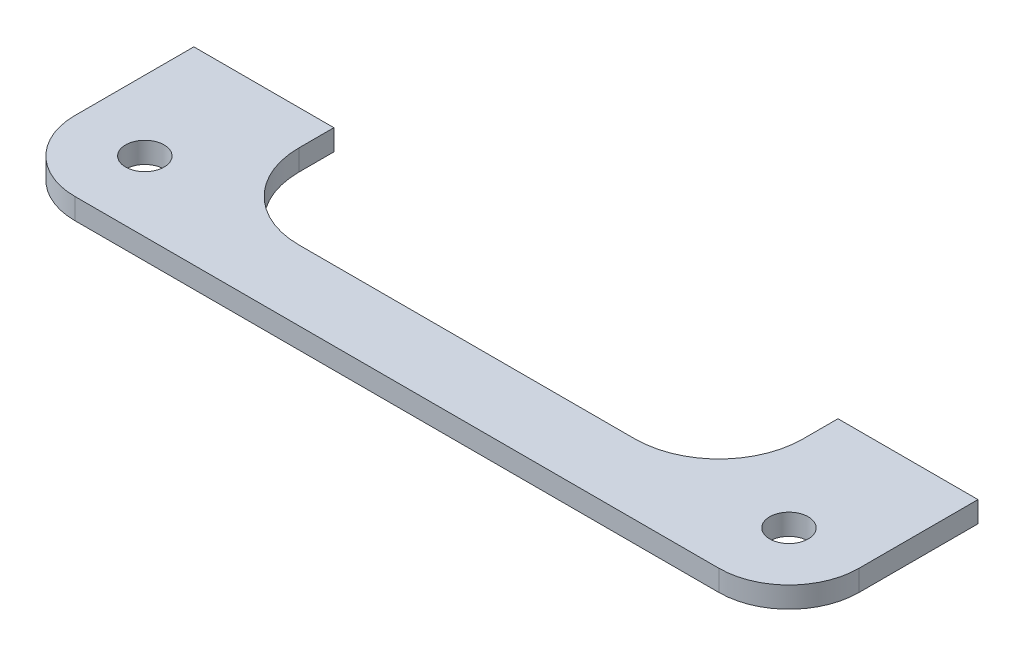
from build123d import *

# Parameters (mm, degrees)
SKETCH1_R      = 2.75
EXTRUDE1_DEPTH = 3


with BuildPart() as part:
    # Sketch1 → Extrude1 (new body)
    with BuildSketch(Plane(origin=(0, 0, 0), x_dir=(1, 0, 0), z_dir=(0, 1, 0))):
        with BuildLine():
            Line((10, 0), (102, 0))
            ThreePointArc((102, 0), (109.071067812, 2.928932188), (112, 10))
            Line((112, 10), (112, 27))
            Line((112, 27), (92, 27))
            Line((92, 27), (92, 22))
            ThreePointArc((92, 22), (88.485281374, 13.514718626), (80, 10))
            Line((80, 10), (32, 10))
            ThreePointArc((32, 10), (23.514718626, 13.514718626), (20, 22))
            Line((20, 22), (20, 27))
            Line((20, 27), (0, 27))
            Line((0, 27), (0, 10))
            ThreePointArc((0, 10), (2.928932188, 2.928932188), (10, 0))
        make_face()
        with Locations(Location((10, 10, 0), (0, 0, 270))):
            Circle(SKETCH1_R, mode=Mode.SUBTRACT)
        with Locations(Location((102, 10, 0), (0, 0, 270))):
            Circle(SKETCH1_R, mode=Mode.SUBTRACT)
    extrude(amount=EXTRUDE1_DEPTH)


solid = part.part
